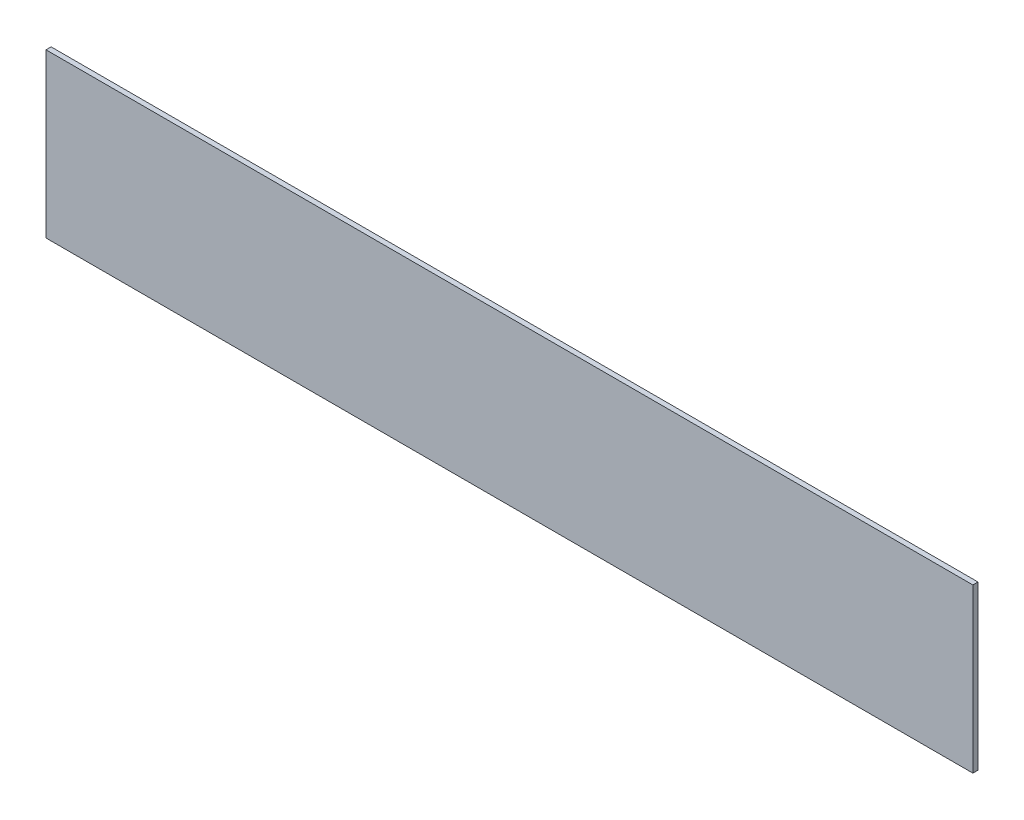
ISO-10303-21;
HEADER;
FILE_DESCRIPTION(('STEP AP214'),'2;1');
FILE_NAME('part.step','',(''),(''),'','','');
FILE_SCHEMA(('AUTOMOTIVE_DESIGN { 1 0 10303 214 1 1 1 1 }'));
ENDSEC;
DATA;
#1=APPLICATION_CONTEXT('core data for automotive mechanical design processes');
#2=APPLICATION_PROTOCOL_DEFINITION('international standard','automotive_design',2000,#1);
#3=PRODUCT_CONTEXT('',#1,'mechanical');
#4=PRODUCT('Part','Part','',(#3));
#5=PRODUCT_RELATED_PRODUCT_CATEGORY('part','',(#4));
#6=PRODUCT_DEFINITION_FORMATION('','',#4);
#7=PRODUCT_DEFINITION_CONTEXT('part definition',#1,'design');
#8=PRODUCT_DEFINITION('design','',#6,#7);
#9=PRODUCT_DEFINITION_SHAPE('','',#8);
#10=(LENGTH_UNIT() NAMED_UNIT(*) SI_UNIT(.MILLI.,.METRE.));
#11=(NAMED_UNIT(*) PLANE_ANGLE_UNIT() SI_UNIT($,.RADIAN.));
#12=(NAMED_UNIT(*) SI_UNIT($,.STERADIAN.) SOLID_ANGLE_UNIT());
#13=UNCERTAINTY_MEASURE_WITH_UNIT(LENGTH_MEASURE(1.E-05),#10,'distance_accuracy_value','');
#14=(GEOMETRIC_REPRESENTATION_CONTEXT(3) GLOBAL_UNCERTAINTY_ASSIGNED_CONTEXT((#13)) GLOBAL_UNIT_ASSIGNED_CONTEXT((#10,
#11,#12)) REPRESENTATION_CONTEXT('',''));
#15=CARTESIAN_POINT('',(0.,0.,0.));
#16=DIRECTION('',(0.,0.,1.));
#17=DIRECTION('',(1.,0.,0.));
#18=AXIS2_PLACEMENT_3D('',#15,#16,#17);
#19=CARTESIAN_POINT('',(-36.25,6.375,0.4));
#20=DIRECTION('',(1.,0.,0.));
#21=DIRECTION('',(0.,0.,-1.));
#22=AXIS2_PLACEMENT_3D('',#19,#20,#21);
#23=PLANE('',#22);
#24=DIRECTION('',(0.,-1.,0.));
#25=VECTOR('',#24,1.);
#26=CARTESIAN_POINT('',(-36.25,6.375,0.));
#27=LINE('',#26,#25);
#28=CARTESIAN_POINT('',(-36.25,6.375,0.));
#29=VERTEX_POINT('',#28);
#30=CARTESIAN_POINT('',(-36.25,-6.375,0.));
#31=VERTEX_POINT('',#30);
#32=EDGE_CURVE('E105',#29,#31,#27,.T.);
#33=ORIENTED_EDGE('',*,*,#32,.T.);
#34=DIRECTION('',(0.,0.,-1.));
#35=VECTOR('',#34,1.);
#36=CARTESIAN_POINT('',(-36.25,-6.375,0.4));
#37=LINE('',#36,#35);
#38=CARTESIAN_POINT('',(-36.25,-6.375,0.4));
#39=VERTEX_POINT('',#38);
#40=EDGE_CURVE('E11',#39,#31,#37,.T.);
#41=ORIENTED_EDGE('',*,*,#40,.F.);
#42=DIRECTION('',(0.,-1.,0.));
#43=VECTOR('',#42,1.);
#44=CARTESIAN_POINT('',(-36.25,6.375,0.4));
#45=LINE('',#44,#43);
#46=CARTESIAN_POINT('',(-36.25,6.375,0.4));
#47=VERTEX_POINT('',#46);
#48=EDGE_CURVE('E89',#47,#39,#45,.T.);
#49=ORIENTED_EDGE('',*,*,#48,.F.);
#50=DIRECTION('',(0.,0.,-1.));
#51=VECTOR('',#50,1.);
#52=CARTESIAN_POINT('',(-36.25,6.375,0.4));
#53=LINE('',#52,#51);
#54=EDGE_CURVE('E101',#47,#29,#53,.T.);
#55=ORIENTED_EDGE('',*,*,#54,.T.);
#56=EDGE_LOOP('',(#33,#41,#49,#55));
#57=FACE_BOUND('',#56,.T.);
#58=ADVANCED_FACE('F37',(#57),#23,.F.);
#59=CARTESIAN_POINT('',(-36.25,-6.375,0.4));
#60=DIRECTION('',(0.,1.,0.));
#61=DIRECTION('',(-1.,0.,0.));
#62=AXIS2_PLACEMENT_3D('',#59,#60,#61);
#63=PLANE('',#62);
#64=DIRECTION('',(1.,0.,0.));
#65=VECTOR('',#64,1.);
#66=CARTESIAN_POINT('',(-36.25,-6.375,0.));
#67=LINE('',#66,#65);
#68=CARTESIAN_POINT('',(36.25,-6.375,0.));
#69=VERTEX_POINT('',#68);
#70=EDGE_CURVE('E94',#31,#69,#67,.T.);
#71=ORIENTED_EDGE('',*,*,#70,.T.);
#72=DIRECTION('',(0.,0.,-1.));
#73=VECTOR('',#72,1.);
#74=CARTESIAN_POINT('',(36.25,-6.375,0.4));
#75=LINE('',#74,#73);
#76=CARTESIAN_POINT('',(36.25,-6.375,0.4));
#77=VERTEX_POINT('',#76);
#78=EDGE_CURVE('E46',#77,#69,#75,.T.);
#79=ORIENTED_EDGE('',*,*,#78,.F.);
#80=DIRECTION('',(1.,0.,0.));
#81=VECTOR('',#80,1.);
#82=CARTESIAN_POINT('',(-36.25,-6.375,0.4));
#83=LINE('',#82,#81);
#84=EDGE_CURVE('E84',#39,#77,#83,.T.);
#85=ORIENTED_EDGE('',*,*,#84,.F.);
#86=ORIENTED_EDGE('',*,*,#40,.T.);
#87=EDGE_LOOP('',(#71,#79,#85,#86));
#88=FACE_BOUND('',#87,.T.);
#89=ADVANCED_FACE('F93',(#88),#63,.F.);
#90=CARTESIAN_POINT('',(36.25,6.375,0.4));
#91=DIRECTION('',(-1.,0.,0.));
#92=DIRECTION('',(0.,0.,1.));
#93=AXIS2_PLACEMENT_3D('',#90,#91,#92);
#94=PLANE('',#93);
#95=DIRECTION('',(0.,1.,0.));
#96=VECTOR('',#95,1.);
#97=CARTESIAN_POINT('',(36.25,6.375,0.));
#98=LINE('',#97,#96);
#99=CARTESIAN_POINT('',(36.25,6.375,0.));
#100=VERTEX_POINT('',#99);
#101=EDGE_CURVE('E71',#69,#100,#98,.T.);
#102=ORIENTED_EDGE('',*,*,#101,.T.);
#103=DIRECTION('',(0.,0.,-1.));
#104=VECTOR('',#103,1.);
#105=CARTESIAN_POINT('',(36.25,6.375,0.4));
#106=LINE('',#105,#104);
#107=CARTESIAN_POINT('',(36.25,6.375,0.4));
#108=VERTEX_POINT('',#107);
#109=EDGE_CURVE('E96',#108,#100,#106,.T.);
#110=ORIENTED_EDGE('',*,*,#109,.F.);
#111=DIRECTION('',(0.,1.,0.));
#112=VECTOR('',#111,1.);
#113=CARTESIAN_POINT('',(36.25,6.375,0.4));
#114=LINE('',#113,#112);
#115=EDGE_CURVE('E87',#77,#108,#114,.T.);
#116=ORIENTED_EDGE('',*,*,#115,.F.);
#117=ORIENTED_EDGE('',*,*,#78,.T.);
#118=EDGE_LOOP('',(#102,#110,#116,#117));
#119=FACE_BOUND('',#118,.T.);
#120=ADVANCED_FACE('F97',(#119),#94,.F.);
#121=CARTESIAN_POINT('',(-36.25,6.375,0.4));
#122=DIRECTION('',(0.,-1.,0.));
#123=DIRECTION('',(0.,0.,-1.));
#124=AXIS2_PLACEMENT_3D('',#121,#122,#123);
#125=PLANE('',#124);
#126=DIRECTION('',(-1.,0.,0.));
#127=VECTOR('',#126,1.);
#128=CARTESIAN_POINT('',(-36.25,6.375,0.));
#129=LINE('',#128,#127);
#130=EDGE_CURVE('E77',#100,#29,#129,.T.);
#131=ORIENTED_EDGE('',*,*,#130,.T.);
#132=ORIENTED_EDGE('',*,*,#54,.F.);
#133=DIRECTION('',(-1.,0.,0.));
#134=VECTOR('',#133,1.);
#135=CARTESIAN_POINT('',(-36.25,6.375,0.4));
#136=LINE('',#135,#134);
#137=EDGE_CURVE('E54',#108,#47,#136,.T.);
#138=ORIENTED_EDGE('',*,*,#137,.F.);
#139=ORIENTED_EDGE('',*,*,#109,.T.);
#140=EDGE_LOOP('',(#131,#132,#138,#139));
#141=FACE_BOUND('',#140,.T.);
#142=ADVANCED_FACE('F118',(#141),#125,.F.);
#143=CARTESIAN_POINT('',(0.,0.,0.4));
#144=DIRECTION('',(0.,0.,1.));
#145=DIRECTION('',(1.,0.,0.));
#146=AXIS2_PLACEMENT_3D('',#143,#144,#145);
#147=PLANE('',#146);
#148=ORIENTED_EDGE('',*,*,#48,.T.);
#149=ORIENTED_EDGE('',*,*,#84,.T.);
#150=ORIENTED_EDGE('',*,*,#115,.T.);
#151=ORIENTED_EDGE('',*,*,#137,.T.);
#152=EDGE_LOOP('',(#148,#149,#150,#151));
#153=FACE_BOUND('',#152,.T.);
#154=ADVANCED_FACE('F85',(#153),#147,.T.);
#155=CARTESIAN_POINT('',(0.,0.,0.));
#156=DIRECTION('',(0.,0.,1.));
#157=DIRECTION('',(1.,0.,0.));
#158=AXIS2_PLACEMENT_3D('',#155,#156,#157);
#159=PLANE('',#158);
#160=ORIENTED_EDGE('',*,*,#32,.F.);
#161=ORIENTED_EDGE('',*,*,#130,.F.);
#162=ORIENTED_EDGE('',*,*,#101,.F.);
#163=ORIENTED_EDGE('',*,*,#70,.F.);
#164=EDGE_LOOP('',(#160,#161,#162,#163));
#165=FACE_BOUND('',#164,.T.);
#166=ADVANCED_FACE('F121',(#165),#159,.F.);
#167=CLOSED_SHELL('',(#58,#89,#120,#142,#154,#166));
#168=MANIFOLD_SOLID_BREP('B2',#167);
#169=ADVANCED_BREP_SHAPE_REPRESENTATION('',(#18,#168),#14);
#170=SHAPE_DEFINITION_REPRESENTATION(#9,#169);
ENDSEC;
END-ISO-10303-21;
